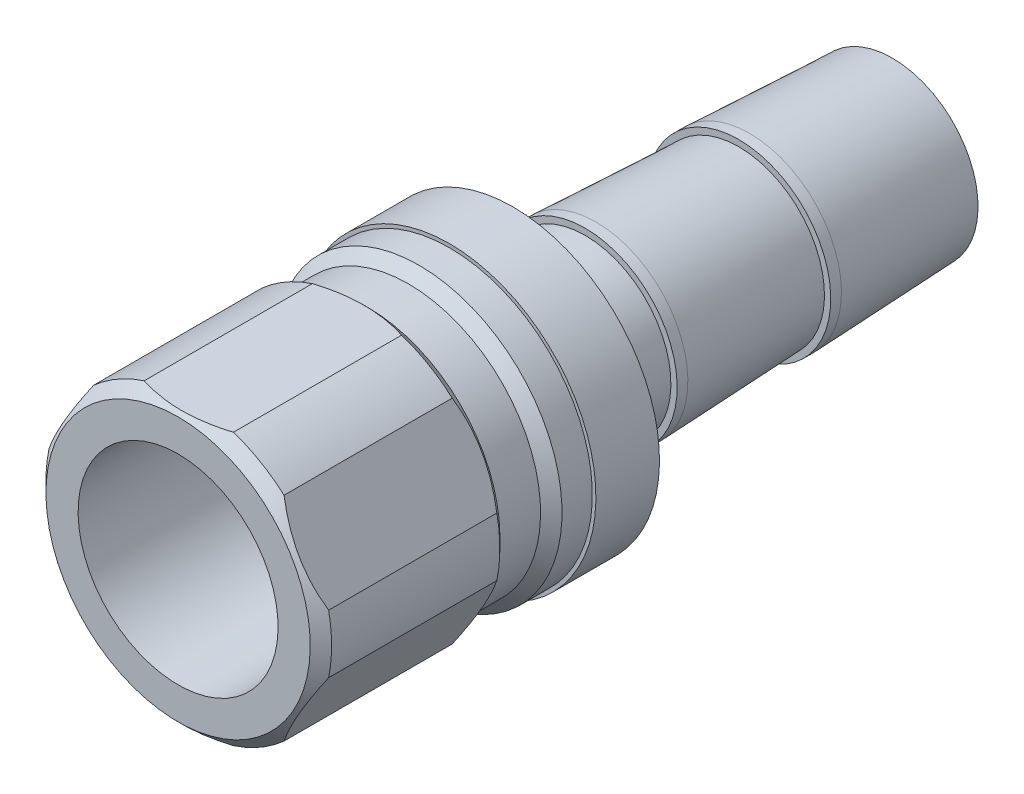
ISO-10303-21;
HEADER;
FILE_DESCRIPTION(('STEP AP214'),'2;1');
FILE_NAME('part.step','',(''),(''),'','','');
FILE_SCHEMA(('AUTOMOTIVE_DESIGN { 1 0 10303 214 1 1 1 1 }'));
ENDSEC;
DATA;
#1=APPLICATION_CONTEXT('core data for automotive mechanical design processes');
#2=APPLICATION_PROTOCOL_DEFINITION('international standard','automotive_design',2000,#1);
#3=PRODUCT_CONTEXT('',#1,'mechanical');
#4=PRODUCT('Part','Part','',(#3));
#5=PRODUCT_RELATED_PRODUCT_CATEGORY('part','',(#4));
#6=PRODUCT_DEFINITION_FORMATION('','',#4);
#7=PRODUCT_DEFINITION_CONTEXT('part definition',#1,'design');
#8=PRODUCT_DEFINITION('design','',#6,#7);
#9=PRODUCT_DEFINITION_SHAPE('','',#8);
#10=(LENGTH_UNIT() NAMED_UNIT(*) SI_UNIT(.MILLI.,.METRE.));
#11=(NAMED_UNIT(*) PLANE_ANGLE_UNIT() SI_UNIT($,.RADIAN.));
#12=(NAMED_UNIT(*) SI_UNIT($,.STERADIAN.) SOLID_ANGLE_UNIT());
#13=UNCERTAINTY_MEASURE_WITH_UNIT(LENGTH_MEASURE(1.E-05),#10,'distance_accuracy_value','');
#14=(GEOMETRIC_REPRESENTATION_CONTEXT(3) GLOBAL_UNCERTAINTY_ASSIGNED_CONTEXT((#13)) GLOBAL_UNIT_ASSIGNED_CONTEXT((#10,
#11,#12)) REPRESENTATION_CONTEXT('',''));
#15=CARTESIAN_POINT('',(0.,0.,0.));
#16=DIRECTION('',(0.,0.,1.));
#17=DIRECTION('',(1.,0.,0.));
#18=AXIS2_PLACEMENT_3D('',#15,#16,#17);
#19=CARTESIAN_POINT('',(0.,0.,5.8166));
#20=DIRECTION('',(0.,0.,1.));
#21=DIRECTION('',(0.,-1.,0.));
#22=AXIS2_PLACEMENT_3D('',#19,#20,#21);
#23=CONICAL_SURFACE('',#22,9.398,0.785398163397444);
#24=CARTESIAN_POINT('',(0.,0.,5.8166));
#25=DIRECTION('',(0.,0.,-1.));
#26=DIRECTION('',(0.,1.,0.));
#27=AXIS2_PLACEMENT_3D('',#24,#25,#26);
#28=CIRCLE('',#27,9.398);
#29=CARTESIAN_POINT('',(0.,9.398,5.8166));
#30=VERTEX_POINT('',#29);
#31=EDGE_CURVE('E378',#30,#30,#28,.T.);
#32=ORIENTED_EDGE('',*,*,#31,.F.);
#33=EDGE_LOOP('',(#32));
#34=FACE_BOUND('',#33,.T.);
#35=CARTESIAN_POINT('',(0.,0.,6.5786));
#36=DIRECTION('',(0.,0.,-1.));
#37=DIRECTION('',(0.,1.,0.));
#38=AXIS2_PLACEMENT_3D('',#35,#36,#37);
#39=CIRCLE('',#38,10.16);
#40=CARTESIAN_POINT('',(3.17245898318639,9.652,6.5786));
#41=VERTEX_POINT('',#40);
#42=CARTESIAN_POINT('',(6.77264770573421,7.57343007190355,6.5786));
#43=VERTEX_POINT('',#42);
#44=EDGE_CURVE('E144',#41,#43,#39,.T.);
#45=ORIENTED_EDGE('',*,*,#44,.T.);
#46=CARTESIAN_POINT('',(6.77232747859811,7.57398472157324,6.5788));
#47=CARTESIAN_POINT('',(6.89341829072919,7.36424928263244,6.50311112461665));
#48=CARTESIAN_POINT('',(7.01569298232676,7.15246330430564,6.43459987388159));
#49=CARTESIAN_POINT('',(7.26235241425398,6.72523663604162,6.31373109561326));
#50=CARTESIAN_POINT('',(7.38673927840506,6.50979226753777,6.26139098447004));
#51=CARTESIAN_POINT('',(7.6342103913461,6.08115972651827,6.17583376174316));
#52=CARTESIAN_POINT('',(7.75725829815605,5.86803450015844,6.14220261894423));
#53=CARTESIAN_POINT('',(8.00421289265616,5.44029659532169,6.0935108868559));
#54=CARTESIAN_POINT('',(8.12811912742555,5.22568470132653,6.07844115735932));
#55=CARTESIAN_POINT('',(8.39348588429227,4.76605599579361,6.06671407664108));
#56=CARTESIAN_POINT('',(8.53498085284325,4.52097952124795,6.07292266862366));
#57=CARTESIAN_POINT('',(8.81724838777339,4.03207780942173,6.10993961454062));
#58=CARTESIAN_POINT('',(8.95802033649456,3.78825364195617,6.14076631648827));
#59=CARTESIAN_POINT('',(9.24157809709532,3.2971171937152,6.22661050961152));
#60=CARTESIAN_POINT('',(9.38431610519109,3.04988771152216,6.28225688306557));
#61=CARTESIAN_POINT('',(9.59637283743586,2.68259467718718,6.38192162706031));
#62=CARTESIAN_POINT('',(9.66667910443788,2.56082065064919,6.41781854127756));
#63=CARTESIAN_POINT('',(9.80658614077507,2.31849455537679,6.49463428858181));
#64=CARTESIAN_POINT('',(9.87618706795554,2.1979422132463,6.53555196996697));
#65=CARTESIAN_POINT('',(9.94542691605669,2.07801527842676,6.5788));
#66=B_SPLINE_CURVE_WITH_KNOTS('',3,(#46,#47,#48,#49,#50,#51,#52,#53,#54,#55,#56,#57,#58,#59,#60,
#61,#62,#63,#64,#65),.UNSPECIFIED.,.F.,.F.,(4,2,2,2,2,2,2,2,2,4),(0.,0.761268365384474,
1.52335378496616,2.26782503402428,3.01192953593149,3.85997332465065,4.70864975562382,
5.58017277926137,6.01546212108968,6.45065179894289),.UNSPECIFIED.);
#67=CARTESIAN_POINT('',(9.94510668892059,2.07856992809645,6.5786));
#68=VERTEX_POINT('',#67);
#69=EDGE_CURVE('E196',#43,#68,#66,.T.);
#70=ORIENTED_EDGE('',*,*,#69,.T.);
#71=CARTESIAN_POINT('',(9.94510668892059,-2.07856992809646,6.5786));
#72=VERTEX_POINT('',#71);
#73=EDGE_CURVE('E309',#68,#72,#39,.T.);
#74=ORIENTED_EDGE('',*,*,#73,.T.);
#75=CARTESIAN_POINT('',(9.94542691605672,-2.07801527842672,6.57880000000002));
#76=CARTESIAN_POINT('',(9.82433610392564,-2.28775071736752,6.50311112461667));
#77=CARTESIAN_POINT('',(9.70206141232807,-2.49953669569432,6.4345998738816));
#78=CARTESIAN_POINT('',(9.45540198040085,-2.92676336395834,6.31373109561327));
#79=CARTESIAN_POINT('',(9.33101511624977,-3.14220773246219,6.26139098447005));
#80=CARTESIAN_POINT('',(9.08354400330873,-3.57084027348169,6.17583376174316));
#81=CARTESIAN_POINT('',(8.96049609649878,-3.78396549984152,6.14220261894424));
#82=CARTESIAN_POINT('',(8.71354150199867,-4.21170340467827,6.0935108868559));
#83=CARTESIAN_POINT('',(8.58963526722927,-4.42631529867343,6.07844115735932));
#84=CARTESIAN_POINT('',(8.32426851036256,-4.88594400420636,6.06671407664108));
#85=CARTESIAN_POINT('',(8.18277354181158,-5.13102047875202,6.07292266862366));
#86=CARTESIAN_POINT('',(7.90050600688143,-5.61992219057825,6.10993961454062));
#87=CARTESIAN_POINT('',(7.75973405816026,-5.86374635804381,6.14076631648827));
#88=CARTESIAN_POINT('',(7.47617629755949,-6.35488280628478,6.22661050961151));
#89=CARTESIAN_POINT('',(7.33343828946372,-6.60211228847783,6.28225688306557));
#90=CARTESIAN_POINT('',(7.12138155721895,-6.96940532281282,6.3819216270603));
#91=CARTESIAN_POINT('',(7.05107529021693,-7.09117934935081,6.41781854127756));
#92=CARTESIAN_POINT('',(6.91116825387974,-7.33350544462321,6.49463428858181));
#93=CARTESIAN_POINT('',(6.84156732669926,-7.4540577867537,6.53555196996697));
#94=CARTESIAN_POINT('',(6.77232747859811,-7.57398472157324,6.5788));
#95=B_SPLINE_CURVE_WITH_KNOTS('',3,(#75,#76,#77,#78,#79,#80,#81,#82,#83,#84,#85,#86,#87,#88,#89,
#90,#91,#92,#93,#94),.UNSPECIFIED.,.F.,.F.,(4,2,2,2,2,2,2,2,2,4),(0.,0.761268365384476,
1.52335378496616,2.26782503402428,3.01192953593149,3.85997332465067,4.70864975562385,
5.58017277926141,6.01546212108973,6.45065179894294),.UNSPECIFIED.);
#96=CARTESIAN_POINT('',(6.77264770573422,-7.57343007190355,6.5786));
#97=VERTEX_POINT('',#96);
#98=EDGE_CURVE('E295',#72,#97,#95,.T.);
#99=ORIENTED_EDGE('',*,*,#98,.T.);
#100=CARTESIAN_POINT('',(3.17245898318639,-9.652,6.5786));
#101=VERTEX_POINT('',#100);
#102=EDGE_CURVE('E320',#97,#101,#39,.T.);
#103=ORIENTED_EDGE('',*,*,#102,.T.);
#104=CARTESIAN_POINT('',(-11.1352624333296,-9.652,11.1547858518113));
#105=CARTESIAN_POINT('',(-10.8642266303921,-9.652,10.9500267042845));
#106=CARTESIAN_POINT('',(-10.5916756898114,-9.652,10.7472405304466));
#107=CARTESIAN_POINT('',(-10.0429449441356,-9.652,10.3464982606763));
#108=CARTESIAN_POINT('',(-9.76676424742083,-9.652,10.148543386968));
#109=CARTESIAN_POINT('',(-9.20815506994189,-9.652,9.75694022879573));
#110=CARTESIAN_POINT('',(-8.9256947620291,-9.652,9.56333719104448));
#111=CARTESIAN_POINT('',(-8.35598337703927,-9.652,9.18333627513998));
#112=CARTESIAN_POINT('',(-8.06873264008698,-9.652,8.99693788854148));
#113=CARTESIAN_POINT('',(-7.47202445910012,-9.652,8.62250123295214));
#114=CARTESIAN_POINT('',(-7.16223889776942,-9.652,8.43498320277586));
#115=CARTESIAN_POINT('',(-6.53543448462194,-9.652,8.07225423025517));
#116=CARTESIAN_POINT('',(-6.21841449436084,-9.652,7.89704524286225));
#117=CARTESIAN_POINT('',(-5.57716584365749,-9.652,7.56271276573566));
#118=CARTESIAN_POINT('',(-5.25296203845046,-9.652,7.4035419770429));
#119=CARTESIAN_POINT('',(-4.59569857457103,-9.652,7.10484931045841));
#120=CARTESIAN_POINT('',(-4.26264301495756,-9.652,6.96531851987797));
#121=CARTESIAN_POINT('',(-3.61460795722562,-9.652,6.72121817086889));
#122=CARTESIAN_POINT('',(-3.30035913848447,-9.652,6.61472890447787));
#123=CARTESIAN_POINT('',(-2.66427706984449,-9.652,6.42695824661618));
#124=CARTESIAN_POINT('',(-2.34244330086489,-9.652,6.345678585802));
#125=CARTESIAN_POINT('',(-1.69847617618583,-9.652,6.21393023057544));
#126=CARTESIAN_POINT('',(-1.37645288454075,-9.652,6.16293234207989));
#127=CARTESIAN_POINT('',(-0.728940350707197,-9.652,6.09274073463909));
#128=CARTESIAN_POINT('',(-0.403451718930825,-9.652,6.07354150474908));
#129=CARTESIAN_POINT('',(0.235900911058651,-9.652,6.06838203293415));
#130=CARTESIAN_POINT('',(0.549755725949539,-9.652,6.0812345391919));
#131=CARTESIAN_POINT('',(1.17478731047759,-9.652,6.13684430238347));
#132=CARTESIAN_POINT('',(1.48596381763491,-9.652,6.17960445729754));
#133=CARTESIAN_POINT('',(2.10864801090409,-9.652,6.29342042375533));
#134=CARTESIAN_POINT('',(2.42006612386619,-9.652,6.36495849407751));
#135=CARTESIAN_POINT('',(3.03611422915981,-9.652,6.53250870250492));
#136=CARTESIAN_POINT('',(3.34074477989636,-9.652,6.62851881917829));
#137=CARTESIAN_POINT('',(3.97032129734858,-9.652,6.85076014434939));
#138=CARTESIAN_POINT('',(4.29456666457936,-9.652,6.97895596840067));
#139=CARTESIAN_POINT('',(4.93463916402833,-9.652,7.25503482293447));
#140=CARTESIAN_POINT('',(5.25046229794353,-9.652,7.40292701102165));
#141=CARTESIAN_POINT('',(5.87523128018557,-9.652,7.7148805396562));
#142=CARTESIAN_POINT('',(6.1841515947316,-9.652,7.87899260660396));
#143=CARTESIAN_POINT('',(6.794884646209,-9.652,8.21975931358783));
#144=CARTESIAN_POINT('',(7.09669850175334,-9.652,8.3964119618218));
#145=CARTESIAN_POINT('',(7.67930267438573,-9.652,8.7507548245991));
#146=CARTESIAN_POINT('',(7.96039189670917,-9.652,8.92795617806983));
#147=CARTESIAN_POINT('',(8.51774450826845,-9.652,9.28981504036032));
#148=CARTESIAN_POINT('',(8.7940075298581,-9.652,9.47447311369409));
#149=CARTESIAN_POINT('',(9.34009999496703,-9.652,9.84838848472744));
#150=CARTESIAN_POINT('',(9.60996346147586,-9.652,10.037596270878));
#151=CARTESIAN_POINT('',(10.1460016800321,-9.652,10.421018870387));
#152=CARTESIAN_POINT('',(10.412177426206,-9.652,10.6152322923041));
#153=CARTESIAN_POINT('',(10.6768088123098,-9.652,10.8114923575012));
#154=B_SPLINE_CURVE_WITH_KNOTS('',3,(#104,#105,#106,#107,#108,#109,#110,#111,#112,#113,#114,
#115,#116,#117,#118,#119,#120,#121,#122,#123,#124,#125,#126,#127,#128,#129,#130,#131,#132,#133,
#134,#135,#136,#137,#138,#139,#140,#141,#142,#143,#144,#145,#146,#147,#148,#149,#150,#151,#152,
#153),.UNSPECIFIED.,.F.,.F.,(4,2,2,2,2,2,2,2,2,2,2,2,2,2,2,2,2,2,2,2,2,2,2,2,4),(0.,
1.01907869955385,2.03841258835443,3.06564368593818,4.09280215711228,5.17893148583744,
6.26523292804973,7.348230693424,8.43073539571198,9.42526640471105,10.419865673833,
11.3965289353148,12.3730229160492,13.3138869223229,14.25484210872,15.2122703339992,
16.1696194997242,17.2148092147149,18.2604865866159,19.3095444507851,20.3584360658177,
21.3551444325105,22.351928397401,23.3406197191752,24.3290391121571),.UNSPECIFIED.);
#155=CARTESIAN_POINT('',(-3.17245898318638,-9.652,6.5786));
#156=VERTEX_POINT('',#155);
#157=EDGE_CURVE('E321',#101,#156,#154,.F.);
#158=ORIENTED_EDGE('',*,*,#157,.T.);
#159=CARTESIAN_POINT('',(-6.77264770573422,-7.57343007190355,6.5786));
#160=VERTEX_POINT('',#159);
#161=EDGE_CURVE('E375',#156,#160,#39,.T.);
#162=ORIENTED_EDGE('',*,*,#161,.T.);
#163=CARTESIAN_POINT('',(-6.77232747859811,-7.57398472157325,6.5788));
#164=CARTESIAN_POINT('',(-6.89341829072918,-7.36424928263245,6.50311112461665));
#165=CARTESIAN_POINT('',(-7.01569298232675,-7.15246330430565,6.43459987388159));
#166=CARTESIAN_POINT('',(-7.26235241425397,-6.72523663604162,6.31373109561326));
#167=CARTESIAN_POINT('',(-7.38673927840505,-6.50979226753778,6.26139098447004));
#168=CARTESIAN_POINT('',(-7.6342103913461,-6.08115972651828,6.17583376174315));
#169=CARTESIAN_POINT('',(-7.75725829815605,-5.86803450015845,6.14220261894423));
#170=CARTESIAN_POINT('',(-8.00421289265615,-5.4402965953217,6.0935108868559));
#171=CARTESIAN_POINT('',(-8.12811912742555,-5.22568470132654,6.07844115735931));
#172=CARTESIAN_POINT('',(-8.39348588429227,-4.76605599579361,6.06671407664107));
#173=CARTESIAN_POINT('',(-8.53498085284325,-4.52097952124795,6.07292266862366));
#174=CARTESIAN_POINT('',(-8.81724838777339,-4.03207780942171,6.10993961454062));
#175=CARTESIAN_POINT('',(-8.95802033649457,-3.78825364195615,6.14076631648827));
#176=CARTESIAN_POINT('',(-9.24157809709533,-3.29711719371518,6.22661050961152));
#177=CARTESIAN_POINT('',(-9.38431610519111,-3.04988771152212,6.28225688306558));
#178=CARTESIAN_POINT('',(-9.59637283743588,-2.68259467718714,6.38192162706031));
#179=CARTESIAN_POINT('',(-9.6666791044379,-2.56082065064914,6.41781854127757));
#180=CARTESIAN_POINT('',(-9.80658614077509,-2.31849455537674,6.49463428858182));
#181=CARTESIAN_POINT('',(-9.87618706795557,-2.19794221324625,6.53555196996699));
#182=CARTESIAN_POINT('',(-9.94542691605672,-2.07801527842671,6.57880000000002));
#183=B_SPLINE_CURVE_WITH_KNOTS('',3,(#163,#164,#165,#166,#167,#168,#169,#170,#171,#172,#173,
#174,#175,#176,#177,#178,#179,#180,#181,#182),.UNSPECIFIED.,.F.,.F.,(4,2,2,2,2,2,2,2,2,4),(0.,
0.761268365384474,1.52335378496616,2.26782503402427,3.01192953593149,3.85997332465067,
4.70864975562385,5.58017277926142,6.01546212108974,6.45065179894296),.UNSPECIFIED.);
#184=CARTESIAN_POINT('',(-9.94510668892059,-2.07856992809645,6.5786));
#185=VERTEX_POINT('',#184);
#186=EDGE_CURVE('E333',#160,#185,#183,.T.);
#187=ORIENTED_EDGE('',*,*,#186,.T.);
#188=CARTESIAN_POINT('',(-9.94510668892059,2.07856992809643,6.5786));
#189=VERTEX_POINT('',#188);
#190=EDGE_CURVE('E154',#185,#189,#39,.T.);
#191=ORIENTED_EDGE('',*,*,#190,.T.);
#192=CARTESIAN_POINT('',(-9.9454269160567,2.07801527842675,6.5788));
#193=CARTESIAN_POINT('',(-9.82433610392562,2.28775071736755,6.50311112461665));
#194=CARTESIAN_POINT('',(-9.70206141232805,2.49953669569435,6.43459987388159));
#195=CARTESIAN_POINT('',(-9.45540198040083,2.92676336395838,6.31373109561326));
#196=CARTESIAN_POINT('',(-9.33101511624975,3.14220773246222,6.26139098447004));
#197=CARTESIAN_POINT('',(-9.0835440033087,3.57084027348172,6.17583376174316));
#198=CARTESIAN_POINT('',(-8.96049609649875,3.78396549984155,6.14220261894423));
#199=CARTESIAN_POINT('',(-8.71354150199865,4.2117034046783,6.0935108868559));
#200=CARTESIAN_POINT('',(-8.58963526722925,4.42631529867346,6.07844115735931));
#201=CARTESIAN_POINT('',(-8.32426851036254,4.88594400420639,6.06671407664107));
#202=CARTESIAN_POINT('',(-8.18277354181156,5.13102047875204,6.07292266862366));
#203=CARTESIAN_POINT('',(-7.90050600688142,5.61992219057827,6.10993961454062));
#204=CARTESIAN_POINT('',(-7.75973405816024,5.86374635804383,6.14076631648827));
#205=CARTESIAN_POINT('',(-7.47617629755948,6.3548828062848,6.22661050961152));
#206=CARTESIAN_POINT('',(-7.33343828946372,6.60211228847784,6.28225688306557));
#207=CARTESIAN_POINT('',(-7.12138155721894,6.96940532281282,6.3819216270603));
#208=CARTESIAN_POINT('',(-7.05107529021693,7.09117934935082,6.41781854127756));
#209=CARTESIAN_POINT('',(-6.91116825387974,7.33350544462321,6.49463428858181));
#210=CARTESIAN_POINT('',(-6.84156732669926,7.4540577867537,6.53555196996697));
#211=CARTESIAN_POINT('',(-6.77232747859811,7.57398472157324,6.5788));
#212=B_SPLINE_CURVE_WITH_KNOTS('',3,(#192,#193,#194,#195,#196,#197,#198,#199,#200,#201,#202,
#203,#204,#205,#206,#207,#208,#209,#210,#211),.UNSPECIFIED.,.F.,.F.,(4,2,2,2,2,2,2,2,2,4),(0.,
0.761268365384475,1.52335378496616,2.26782503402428,3.01192953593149,3.85997332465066,
4.70864975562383,5.58017277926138,6.01546212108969,6.4506517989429),.UNSPECIFIED.);
#213=CARTESIAN_POINT('',(-6.7726477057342,7.57343007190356,6.5786));
#214=VERTEX_POINT('',#213);
#215=EDGE_CURVE('E351',#189,#214,#212,.T.);
#216=ORIENTED_EDGE('',*,*,#215,.T.);
#217=CARTESIAN_POINT('',(-3.17245898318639,9.652,6.5786));
#218=VERTEX_POINT('',#217);
#219=EDGE_CURVE('E149',#214,#218,#39,.T.);
#220=ORIENTED_EDGE('',*,*,#219,.T.);
#221=CARTESIAN_POINT('',(-11.1352624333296,9.652,11.1547858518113));
#222=CARTESIAN_POINT('',(-10.8642266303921,9.652,10.9500267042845));
#223=CARTESIAN_POINT('',(-10.5916756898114,9.652,10.7472405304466));
#224=CARTESIAN_POINT('',(-10.0429449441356,9.652,10.3464982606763));
#225=CARTESIAN_POINT('',(-9.76676424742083,9.652,10.148543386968));
#226=CARTESIAN_POINT('',(-9.20815506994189,9.652,9.75694022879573));
#227=CARTESIAN_POINT('',(-8.9256947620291,9.652,9.56333719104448));
#228=CARTESIAN_POINT('',(-8.35598337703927,9.652,9.18333627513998));
#229=CARTESIAN_POINT('',(-8.06873264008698,9.652,8.99693788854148));
#230=CARTESIAN_POINT('',(-7.47202445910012,9.652,8.62250123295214));
#231=CARTESIAN_POINT('',(-7.16223889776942,9.652,8.43498320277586));
#232=CARTESIAN_POINT('',(-6.53543448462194,9.652,8.07225423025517));
#233=CARTESIAN_POINT('',(-6.21841449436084,9.652,7.89704524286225));
#234=CARTESIAN_POINT('',(-5.57716584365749,9.652,7.56271276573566));
#235=CARTESIAN_POINT('',(-5.25296203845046,9.652,7.4035419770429));
#236=CARTESIAN_POINT('',(-4.59569857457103,9.652,7.10484931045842));
#237=CARTESIAN_POINT('',(-4.26264301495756,9.652,6.96531851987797));
#238=CARTESIAN_POINT('',(-3.61460795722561,9.652,6.72121817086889));
#239=CARTESIAN_POINT('',(-3.30035913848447,9.652,6.61472890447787));
#240=CARTESIAN_POINT('',(-2.66427706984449,9.652,6.42695824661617));
#241=CARTESIAN_POINT('',(-2.34244330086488,9.652,6.345678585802));
#242=CARTESIAN_POINT('',(-1.69847617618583,9.652,6.21393023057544));
#243=CARTESIAN_POINT('',(-1.37645288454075,9.652,6.16293234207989));
#244=CARTESIAN_POINT('',(-0.728940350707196,9.652,6.09274073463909));
#245=CARTESIAN_POINT('',(-0.403451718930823,9.652,6.07354150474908));
#246=CARTESIAN_POINT('',(0.235900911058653,9.652,6.06838203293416));
#247=CARTESIAN_POINT('',(0.54975572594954,9.652,6.0812345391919));
#248=CARTESIAN_POINT('',(1.17478731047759,9.652,6.13684430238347));
#249=CARTESIAN_POINT('',(1.48596381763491,9.652,6.17960445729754));
#250=CARTESIAN_POINT('',(2.10864801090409,9.652,6.29342042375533));
#251=CARTESIAN_POINT('',(2.42006612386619,9.652,6.36495849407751));
#252=CARTESIAN_POINT('',(3.03611422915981,9.652,6.53250870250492));
#253=CARTESIAN_POINT('',(3.34074477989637,9.652,6.62851881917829));
#254=CARTESIAN_POINT('',(3.97032129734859,9.652,6.8507601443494));
#255=CARTESIAN_POINT('',(4.29456666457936,9.652,6.97895596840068));
#256=CARTESIAN_POINT('',(4.93463916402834,9.652,7.25503482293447));
#257=CARTESIAN_POINT('',(5.25046229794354,9.652,7.40292701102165));
#258=CARTESIAN_POINT('',(5.87523128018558,9.652,7.71488053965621));
#259=CARTESIAN_POINT('',(6.18415159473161,9.652,7.87899260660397));
#260=CARTESIAN_POINT('',(6.794884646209,9.652,8.21975931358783));
#261=CARTESIAN_POINT('',(7.09669850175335,9.652,8.3964119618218));
#262=CARTESIAN_POINT('',(7.67930267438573,9.652,8.75075482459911));
#263=CARTESIAN_POINT('',(7.96039189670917,9.652,8.92795617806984));
#264=CARTESIAN_POINT('',(8.51774450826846,9.652,9.28981504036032));
#265=CARTESIAN_POINT('',(8.7940075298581,9.652,9.47447311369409));
#266=CARTESIAN_POINT('',(9.34009999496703,9.652,9.84838848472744));
#267=CARTESIAN_POINT('',(9.60996346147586,9.652,10.037596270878));
#268=CARTESIAN_POINT('',(10.1460016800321,9.652,10.421018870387));
#269=CARTESIAN_POINT('',(10.412177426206,9.652,10.6152322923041));
#270=CARTESIAN_POINT('',(10.6768088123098,9.652,10.8114923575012));
#271=B_SPLINE_CURVE_WITH_KNOTS('',3,(#221,#222,#223,#224,#225,#226,#227,#228,#229,#230,#231,
#232,#233,#234,#235,#236,#237,#238,#239,#240,#241,#242,#243,#244,#245,#246,#247,#248,#249,#250,
#251,#252,#253,#254,#255,#256,#257,#258,#259,#260,#261,#262,#263,#264,#265,#266,#267,#268,#269,
#270),.UNSPECIFIED.,.F.,.F.,(4,2,2,2,2,2,2,2,2,2,2,2,2,2,2,2,2,2,2,2,2,2,2,2,4),(0.,
1.01907869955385,2.03841258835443,3.06564368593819,4.09280215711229,5.17893148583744,
6.26523292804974,7.348230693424,8.43073539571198,9.42526640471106,10.419865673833,
11.3965289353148,12.3730229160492,13.3138869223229,14.25484210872,15.2122703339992,
16.1696194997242,17.2148092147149,18.2604865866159,19.3095444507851,20.3584360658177,
21.3551444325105,22.351928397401,23.3406197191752,24.3290391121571),.UNSPECIFIED.);
#272=EDGE_CURVE('E145',#218,#41,#271,.T.);
#273=ORIENTED_EDGE('',*,*,#272,.T.);
#274=EDGE_LOOP('',(#45,#70,#74,#99,#103,#158,#162,#187,#191,#216,#220,#273));
#275=FACE_BOUND('',#274,.T.);
#276=ADVANCED_FACE('F34',(#34,#275),#23,.T.);
#277=CARTESIAN_POINT('',(0.,0.,0.));
#278=DIRECTION('',(0.,0.,-1.));
#279=DIRECTION('',(0.,1.,0.));
#280=AXIS2_PLACEMENT_3D('',#277,#278,#279);
#281=CYLINDRICAL_SURFACE('',#280,10.16);
#282=ORIENTED_EDGE('',*,*,#73,.F.);
#283=DIRECTION('',(0.,0.,-1.));
#284=VECTOR('',#283,1.);
#285=CARTESIAN_POINT('',(9.94510668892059,2.07856992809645,0.));
#286=LINE('',#285,#284);
#287=CARTESIAN_POINT('',(9.94510668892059,2.07856992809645,18.542));
#288=VERTEX_POINT('',#287);
#289=EDGE_CURVE('E203',#68,#288,#286,.F.);
#290=ORIENTED_EDGE('',*,*,#289,.T.);
#291=CARTESIAN_POINT('',(0.,0.,18.542));
#292=DIRECTION('',(0.,0.,-1.));
#293=DIRECTION('',(0.,1.,0.));
#294=AXIS2_PLACEMENT_3D('',#291,#292,#293);
#295=CIRCLE('',#294,10.16);
#296=CARTESIAN_POINT('',(9.9451066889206,-2.07856992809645,18.542));
#297=VERTEX_POINT('',#296);
#298=EDGE_CURVE('E150',#288,#297,#295,.T.);
#299=ORIENTED_EDGE('',*,*,#298,.T.);
#300=DIRECTION('',(0.,0.,-1.));
#301=VECTOR('',#300,1.);
#302=CARTESIAN_POINT('',(9.94510668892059,-2.07856992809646,0.));
#303=LINE('',#302,#301);
#304=EDGE_CURVE('E314',#297,#72,#303,.T.);
#305=ORIENTED_EDGE('',*,*,#304,.T.);
#306=EDGE_LOOP('',(#282,#290,#299,#305));
#307=FACE_BOUND('',#306,.T.);
#308=ADVANCED_FACE('F257',(#307),#281,.T.);
#309=CARTESIAN_POINT('',(3.17245898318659,9.652,18.5420000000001));
#310=VERTEX_POINT('',#309);
#311=CARTESIAN_POINT('',(6.77264770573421,7.57343007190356,18.542));
#312=VERTEX_POINT('',#311);
#313=EDGE_CURVE('E142',#310,#312,#295,.T.);
#314=ORIENTED_EDGE('',*,*,#313,.T.);
#315=DIRECTION('',(0.,0.,-1.));
#316=VECTOR('',#315,1.);
#317=CARTESIAN_POINT('',(6.77264770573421,7.57343007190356,0.));
#318=LINE('',#317,#316);
#319=EDGE_CURVE('E301',#312,#43,#318,.T.);
#320=ORIENTED_EDGE('',*,*,#319,.T.);
#321=ORIENTED_EDGE('',*,*,#44,.F.);
#322=DIRECTION('',(0.,0.,-1.));
#323=VECTOR('',#322,1.);
#324=CARTESIAN_POINT('',(3.17245898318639,9.652,0.));
#325=LINE('',#324,#323);
#326=EDGE_CURVE('E128',#41,#310,#325,.F.);
#327=ORIENTED_EDGE('',*,*,#326,.T.);
#328=EDGE_LOOP('',(#314,#320,#321,#327));
#329=FACE_BOUND('',#328,.T.);
#330=ADVANCED_FACE('F140',(#329),#281,.T.);
#331=ORIENTED_EDGE('',*,*,#102,.F.);
#332=DIRECTION('',(0.,0.,-1.));
#333=VECTOR('',#332,1.);
#334=CARTESIAN_POINT('',(6.77264770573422,-7.57343007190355,0.));
#335=LINE('',#334,#333);
#336=CARTESIAN_POINT('',(6.77264770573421,-7.57343007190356,18.542));
#337=VERTEX_POINT('',#336);
#338=EDGE_CURVE('E302',#97,#337,#335,.F.);
#339=ORIENTED_EDGE('',*,*,#338,.T.);
#340=CARTESIAN_POINT('',(3.1724589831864,-9.652,18.542));
#341=VERTEX_POINT('',#340);
#342=EDGE_CURVE('E157',#337,#341,#295,.T.);
#343=ORIENTED_EDGE('',*,*,#342,.T.);
#344=DIRECTION('',(0.,0.,-1.));
#345=VECTOR('',#344,1.);
#346=CARTESIAN_POINT('',(3.17245898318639,-9.652,0.));
#347=LINE('',#346,#345);
#348=EDGE_CURVE('E331',#341,#101,#347,.T.);
#349=ORIENTED_EDGE('',*,*,#348,.T.);
#350=EDGE_LOOP('',(#331,#339,#343,#349));
#351=FACE_BOUND('',#350,.T.);
#352=ADVANCED_FACE('F317',(#351),#281,.T.);
#353=ORIENTED_EDGE('',*,*,#161,.F.);
#354=DIRECTION('',(0.,0.,-1.));
#355=VECTOR('',#354,1.);
#356=CARTESIAN_POINT('',(-3.17245898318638,-9.652,0.));
#357=LINE('',#356,#355);
#358=CARTESIAN_POINT('',(-3.1724589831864,-9.652,18.542));
#359=VERTEX_POINT('',#358);
#360=EDGE_CURVE('E323',#156,#359,#357,.F.);
#361=ORIENTED_EDGE('',*,*,#360,.T.);
#362=CARTESIAN_POINT('',(-6.77264770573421,-7.57343007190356,18.542));
#363=VERTEX_POINT('',#362);
#364=EDGE_CURVE('E164',#359,#363,#295,.T.);
#365=ORIENTED_EDGE('',*,*,#364,.T.);
#366=DIRECTION('',(0.,0.,-1.));
#367=VECTOR('',#366,1.);
#368=CARTESIAN_POINT('',(-6.77264770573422,-7.57343007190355,0.));
#369=LINE('',#368,#367);
#370=EDGE_CURVE('E357',#363,#160,#369,.T.);
#371=ORIENTED_EDGE('',*,*,#370,.T.);
#372=EDGE_LOOP('',(#353,#361,#365,#371));
#373=FACE_BOUND('',#372,.T.);
#374=ADVANCED_FACE('F374',(#373),#281,.T.);
#375=ORIENTED_EDGE('',*,*,#190,.F.);
#376=DIRECTION('',(0.,0.,-1.));
#377=VECTOR('',#376,1.);
#378=CARTESIAN_POINT('',(-9.94510668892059,-2.07856992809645,0.));
#379=LINE('',#378,#377);
#380=CARTESIAN_POINT('',(-9.94510668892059,-2.07856992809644,18.542));
#381=VERTEX_POINT('',#380);
#382=EDGE_CURVE('E339',#185,#381,#379,.F.);
#383=ORIENTED_EDGE('',*,*,#382,.T.);
#384=CARTESIAN_POINT('',(-9.9451066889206,2.07856992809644,18.542));
#385=VERTEX_POINT('',#384);
#386=EDGE_CURVE('E159',#381,#385,#295,.T.);
#387=ORIENTED_EDGE('',*,*,#386,.T.);
#388=DIRECTION('',(0.,0.,-1.));
#389=VECTOR('',#388,1.);
#390=CARTESIAN_POINT('',(-9.94510668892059,2.07856992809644,0.));
#391=LINE('',#390,#389);
#392=EDGE_CURVE('E62',#385,#189,#391,.T.);
#393=ORIENTED_EDGE('',*,*,#392,.T.);
#394=EDGE_LOOP('',(#375,#383,#387,#393));
#395=FACE_BOUND('',#394,.T.);
#396=ADVANCED_FACE('F369',(#395),#281,.T.);
#397=ORIENTED_EDGE('',*,*,#219,.F.);
#398=DIRECTION('',(0.,0.,-1.));
#399=VECTOR('',#398,1.);
#400=CARTESIAN_POINT('',(-6.7726477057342,7.57343007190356,0.));
#401=LINE('',#400,#399);
#402=CARTESIAN_POINT('',(-6.77264770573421,7.57343007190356,18.542));
#403=VERTEX_POINT('',#402);
#404=EDGE_CURVE('E358',#214,#403,#401,.F.);
#405=ORIENTED_EDGE('',*,*,#404,.T.);
#406=CARTESIAN_POINT('',(-3.17245898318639,9.652,18.542));
#407=VERTEX_POINT('',#406);
#408=EDGE_CURVE('E152',#403,#407,#295,.T.);
#409=ORIENTED_EDGE('',*,*,#408,.T.);
#410=DIRECTION('',(0.,0.,-1.));
#411=VECTOR('',#410,1.);
#412=CARTESIAN_POINT('',(-3.17245898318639,9.652,0.));
#413=LINE('',#412,#411);
#414=EDGE_CURVE('E54',#407,#218,#413,.T.);
#415=ORIENTED_EDGE('',*,*,#414,.T.);
#416=EDGE_LOOP('',(#397,#405,#409,#415));
#417=FACE_BOUND('',#416,.T.);
#418=ADVANCED_FACE('F256',(#417),#281,.T.);
#419=CARTESIAN_POINT('',(0.,0.,18.542));
#420=DIRECTION('',(0.,0.,-1.));
#421=DIRECTION('',(0.,1.,0.));
#422=AXIS2_PLACEMENT_3D('',#419,#420,#421);
#423=CONICAL_SURFACE('',#422,10.16,0.785398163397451);
#424=CARTESIAN_POINT('',(0.,0.,19.304));
#425=DIRECTION('',(0.,0.,-1.));
#426=DIRECTION('',(0.,1.,0.));
#427=AXIS2_PLACEMENT_3D('',#424,#425,#426);
#428=CIRCLE('',#427,9.398);
#429=CARTESIAN_POINT('',(0.,9.398,19.304));
#430=VERTEX_POINT('',#429);
#431=EDGE_CURVE('E160',#430,#430,#428,.T.);
#432=ORIENTED_EDGE('',*,*,#431,.T.);
#433=EDGE_LOOP('',(#432));
#434=FACE_BOUND('',#433,.T.);
#435=ORIENTED_EDGE('',*,*,#298,.F.);
#436=CARTESIAN_POINT('',(9.94542691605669,2.07801527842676,18.5418));
#437=CARTESIAN_POINT('',(9.82433610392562,2.28775071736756,18.6174888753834));
#438=CARTESIAN_POINT('',(9.70206141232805,2.49953669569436,18.6860001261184));
#439=CARTESIAN_POINT('',(9.45540198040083,2.92676336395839,18.8068689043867));
#440=CARTESIAN_POINT('',(9.33101511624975,3.14220773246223,18.85920901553));
#441=CARTESIAN_POINT('',(9.0835440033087,3.57084027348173,18.9447662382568));
#442=CARTESIAN_POINT('',(8.96049609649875,3.78396549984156,18.9783973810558));
#443=CARTESIAN_POINT('',(8.71354150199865,4.21170340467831,19.0270891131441));
#444=CARTESIAN_POINT('',(8.58963526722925,4.42631529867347,19.0421588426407));
#445=CARTESIAN_POINT('',(8.32426851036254,4.88594400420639,19.0538859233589));
#446=CARTESIAN_POINT('',(8.18277354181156,5.13102047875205,19.0476773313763));
#447=CARTESIAN_POINT('',(7.90050600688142,5.61992219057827,19.0106603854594));
#448=CARTESIAN_POINT('',(7.75973405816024,5.86374635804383,18.9798336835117));
#449=CARTESIAN_POINT('',(7.47617629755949,6.3548828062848,18.8939894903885));
#450=CARTESIAN_POINT('',(7.33343828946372,6.60211228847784,18.8383431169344));
#451=CARTESIAN_POINT('',(7.12138155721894,6.96940532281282,18.7386783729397));
#452=CARTESIAN_POINT('',(7.05107529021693,7.09117934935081,18.7027814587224));
#453=CARTESIAN_POINT('',(6.91116825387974,7.33350544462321,18.6259657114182));
#454=CARTESIAN_POINT('',(6.84156732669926,7.4540577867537,18.585048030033));
#455=CARTESIAN_POINT('',(6.77232747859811,7.57398472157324,18.5418));
#456=B_SPLINE_CURVE_WITH_KNOTS('',3,(#436,#437,#438,#439,#440,#441,#442,#443,#444,#445,#446,
#447,#448,#449,#450,#451,#452,#453,#454,#455),.UNSPECIFIED.,.F.,.F.,(4,2,2,2,2,2,2,2,2,4),(0.,
0.761268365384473,1.52335378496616,2.26782503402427,3.01192953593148,3.85997332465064,
4.70864975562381,5.58017277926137,6.01546212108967,6.45065179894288),.UNSPECIFIED.);
#457=EDGE_CURVE('E12',#288,#312,#456,.T.);
#458=ORIENTED_EDGE('',*,*,#457,.T.);
#459=ORIENTED_EDGE('',*,*,#313,.F.);
#460=CARTESIAN_POINT('',(-11.1352624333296,9.652,13.9658141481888));
#461=CARTESIAN_POINT('',(-10.8642266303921,9.652,14.1705732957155));
#462=CARTESIAN_POINT('',(-10.5916756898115,9.652,14.3733594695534));
#463=CARTESIAN_POINT('',(-10.0429449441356,9.652,14.7741017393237));
#464=CARTESIAN_POINT('',(-9.76676424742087,9.652,14.972056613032));
#465=CARTESIAN_POINT('',(-9.20815506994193,9.652,15.3636597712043));
#466=CARTESIAN_POINT('',(-8.92569476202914,9.652,15.5572628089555));
#467=CARTESIAN_POINT('',(-8.3559833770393,9.652,15.93726372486));
#468=CARTESIAN_POINT('',(-8.06873264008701,9.652,16.1236621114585));
#469=CARTESIAN_POINT('',(-7.47202445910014,9.652,16.4980987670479));
#470=CARTESIAN_POINT('',(-7.16223889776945,9.652,16.6856167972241));
#471=CARTESIAN_POINT('',(-6.53543448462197,9.652,17.0483457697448));
#472=CARTESIAN_POINT('',(-6.21841449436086,9.652,17.2235547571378));
#473=CARTESIAN_POINT('',(-5.57716584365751,9.652,17.5578872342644));
#474=CARTESIAN_POINT('',(-5.25296203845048,9.652,17.7170580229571));
#475=CARTESIAN_POINT('',(-4.59569857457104,9.652,18.0157506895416));
#476=CARTESIAN_POINT('',(-4.26264301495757,9.652,18.155281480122));
#477=CARTESIAN_POINT('',(-3.61460795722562,9.652,18.3993818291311));
#478=CARTESIAN_POINT('',(-3.30035913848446,9.652,18.5058710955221));
#479=CARTESIAN_POINT('',(-2.66427706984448,9.652,18.6936417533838));
#480=CARTESIAN_POINT('',(-2.34244330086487,9.652,18.774921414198));
#481=CARTESIAN_POINT('',(-1.6984761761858,9.652,18.9066697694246));
#482=CARTESIAN_POINT('',(-1.37645288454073,9.652,18.9576676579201));
#483=CARTESIAN_POINT('',(-0.728940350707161,9.652,19.0278592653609));
#484=CARTESIAN_POINT('',(-0.403451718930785,9.652,19.0470584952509));
#485=CARTESIAN_POINT('',(0.235900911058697,9.652,19.0522179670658));
#486=CARTESIAN_POINT('',(0.549755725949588,9.652,19.0393654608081));
#487=CARTESIAN_POINT('',(1.17478731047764,9.652,18.9837556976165));
#488=CARTESIAN_POINT('',(1.48596381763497,9.652,18.9409955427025));
#489=CARTESIAN_POINT('',(2.10864801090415,9.652,18.8271795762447));
#490=CARTESIAN_POINT('',(2.42006612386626,9.652,18.7556415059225));
#491=CARTESIAN_POINT('',(3.03611422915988,9.652,18.5880912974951));
#492=CARTESIAN_POINT('',(3.34074477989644,9.652,18.4920811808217));
#493=CARTESIAN_POINT('',(3.97032129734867,9.652,18.2698398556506));
#494=CARTESIAN_POINT('',(4.29456666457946,9.652,18.1416440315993));
#495=CARTESIAN_POINT('',(4.93463916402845,9.652,17.8655651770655));
#496=CARTESIAN_POINT('',(5.25046229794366,9.652,17.7176729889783));
#497=CARTESIAN_POINT('',(5.87523128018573,9.652,17.4057194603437));
#498=CARTESIAN_POINT('',(6.18415159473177,9.652,17.241607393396));
#499=CARTESIAN_POINT('',(6.79488464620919,9.652,16.9008406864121));
#500=CARTESIAN_POINT('',(7.09669850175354,9.652,16.7241880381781));
#501=CARTESIAN_POINT('',(7.67930267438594,9.652,16.3698451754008));
#502=CARTESIAN_POINT('',(7.96039189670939,9.652,16.1926438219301));
#503=CARTESIAN_POINT('',(8.5177445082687,9.652,15.8307849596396));
#504=CARTESIAN_POINT('',(8.79400752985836,9.652,15.6461268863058));
#505=CARTESIAN_POINT('',(9.3400999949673,9.652,15.2722115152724));
#506=CARTESIAN_POINT('',(9.60996346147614,9.652,15.0830037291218));
#507=CARTESIAN_POINT('',(10.1460016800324,9.652,14.6995811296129));
#508=CARTESIAN_POINT('',(10.4121774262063,9.652,14.5053677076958));
#509=CARTESIAN_POINT('',(10.6768088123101,9.652,14.3091076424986));
#510=B_SPLINE_CURVE_WITH_KNOTS('',3,(#460,#461,#462,#463,#464,#465,#466,#467,#468,#469,#470,
#471,#472,#473,#474,#475,#476,#477,#478,#479,#480,#481,#482,#483,#484,#485,#486,#487,#488,#489,
#490,#491,#492,#493,#494,#495,#496,#497,#498,#499,#500,#501,#502,#503,#504,#505,#506,#507,#508,
#509),.UNSPECIFIED.,.F.,.F.,(4,2,2,2,2,2,2,2,2,2,2,2,2,2,2,2,2,2,2,2,2,2,2,2,4),(0.,
1.01907869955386,2.03841258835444,3.0656436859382,4.09280215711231,5.17893148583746,
6.26523292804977,7.34823069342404,8.43073539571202,9.4252664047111,10.419865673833,
11.3965289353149,12.3730229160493,13.313886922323,14.2548421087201,15.2122703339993,
16.1696194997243,17.2148092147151,18.2604865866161,19.3095444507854,20.358436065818,
21.3551444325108,22.3519283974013,23.3406197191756,24.3290391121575),.UNSPECIFIED.);
#511=EDGE_CURVE('E125',#310,#407,#510,.F.);
#512=ORIENTED_EDGE('',*,*,#511,.T.);
#513=ORIENTED_EDGE('',*,*,#408,.F.);
#514=CARTESIAN_POINT('',(-6.77232747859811,7.57398472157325,18.5418));
#515=CARTESIAN_POINT('',(-6.89341829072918,7.36424928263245,18.6174888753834));
#516=CARTESIAN_POINT('',(-7.01569298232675,7.15246330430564,18.6860001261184));
#517=CARTESIAN_POINT('',(-7.26235241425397,6.72523663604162,18.8068689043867));
#518=CARTESIAN_POINT('',(-7.38673927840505,6.50979226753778,18.85920901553));
#519=CARTESIAN_POINT('',(-7.6342103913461,6.08115972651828,18.9447662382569));
#520=CARTESIAN_POINT('',(-7.75725829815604,5.86803450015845,18.9783973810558));
#521=CARTESIAN_POINT('',(-8.00421289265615,5.4402965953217,19.0270891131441));
#522=CARTESIAN_POINT('',(-8.12811912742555,5.22568470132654,19.0421588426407));
#523=CARTESIAN_POINT('',(-8.39348588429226,4.76605599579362,19.0538859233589));
#524=CARTESIAN_POINT('',(-8.53498085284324,4.52097952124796,19.0476773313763));
#525=CARTESIAN_POINT('',(-8.81724838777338,4.03207780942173,19.0106603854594));
#526=CARTESIAN_POINT('',(-8.95802033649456,3.78825364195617,18.9798336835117));
#527=CARTESIAN_POINT('',(-9.24157809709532,3.2971171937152,18.8939894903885));
#528=CARTESIAN_POINT('',(-9.38431610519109,3.04988771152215,18.8383431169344));
#529=CARTESIAN_POINT('',(-9.59637283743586,2.68259467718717,18.7386783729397));
#530=CARTESIAN_POINT('',(-9.66667910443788,2.56082065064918,18.7027814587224));
#531=CARTESIAN_POINT('',(-9.80658614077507,2.31849455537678,18.6259657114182));
#532=CARTESIAN_POINT('',(-9.87618706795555,2.19794221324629,18.585048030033));
#533=CARTESIAN_POINT('',(-9.9454269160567,2.07801527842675,18.5418));
#534=B_SPLINE_CURVE_WITH_KNOTS('',3,(#514,#515,#516,#517,#518,#519,#520,#521,#522,#523,#524,
#525,#526,#527,#528,#529,#530,#531,#532,#533),.UNSPECIFIED.,.F.,.F.,(4,2,2,2,2,2,2,2,2,4),(0.,
0.761268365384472,1.52335378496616,2.26782503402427,3.01192953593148,3.85997332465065,
4.70864975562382,5.58017277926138,6.01546212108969,6.4506517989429),.UNSPECIFIED.);
#535=EDGE_CURVE('E134',#403,#385,#534,.T.);
#536=ORIENTED_EDGE('',*,*,#535,.T.);
#537=ORIENTED_EDGE('',*,*,#386,.F.);
#538=CARTESIAN_POINT('',(-9.94542691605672,-2.07801527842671,18.5418));
#539=CARTESIAN_POINT('',(-9.82433610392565,-2.28775071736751,18.6174888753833));
#540=CARTESIAN_POINT('',(-9.70206141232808,-2.49953669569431,18.6860001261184));
#541=CARTESIAN_POINT('',(-9.45540198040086,-2.92676336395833,18.8068689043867));
#542=CARTESIAN_POINT('',(-9.33101511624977,-3.14220773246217,18.85920901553));
#543=CARTESIAN_POINT('',(-9.08354400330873,-3.57084027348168,18.9447662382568));
#544=CARTESIAN_POINT('',(-8.96049609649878,-3.78396549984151,18.9783973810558));
#545=CARTESIAN_POINT('',(-8.71354150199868,-4.21170340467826,19.0270891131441));
#546=CARTESIAN_POINT('',(-8.58963526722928,-4.42631529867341,19.0421588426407));
#547=CARTESIAN_POINT('',(-8.32426851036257,-4.88594400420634,19.0538859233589));
#548=CARTESIAN_POINT('',(-8.18277354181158,-5.13102047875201,19.0476773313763));
#549=CARTESIAN_POINT('',(-7.90050600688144,-5.61992219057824,19.0106603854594));
#550=CARTESIAN_POINT('',(-7.75973405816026,-5.86374635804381,18.9798336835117));
#551=CARTESIAN_POINT('',(-7.47617629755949,-6.35488280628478,18.8939894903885));
#552=CARTESIAN_POINT('',(-7.33343828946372,-6.60211228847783,18.8383431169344));
#553=CARTESIAN_POINT('',(-7.12138155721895,-6.96940532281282,18.7386783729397));
#554=CARTESIAN_POINT('',(-7.05107529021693,-7.09117934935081,18.7027814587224));
#555=CARTESIAN_POINT('',(-6.91116825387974,-7.33350544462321,18.6259657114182));
#556=CARTESIAN_POINT('',(-6.84156732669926,-7.4540577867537,18.585048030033));
#557=CARTESIAN_POINT('',(-6.77232747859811,-7.57398472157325,18.5418));
#558=B_SPLINE_CURVE_WITH_KNOTS('',3,(#538,#539,#540,#541,#542,#543,#544,#545,#546,#547,#548,
#549,#550,#551,#552,#553,#554,#555,#556,#557),.UNSPECIFIED.,.F.,.F.,(4,2,2,2,2,2,2,2,2,4),(0.,
0.761268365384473,1.52335378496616,2.26782503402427,3.01192953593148,3.85997332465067,
4.70864975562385,5.58017277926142,6.01546212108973,6.45065179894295),.UNSPECIFIED.);
#559=EDGE_CURVE('E272',#381,#363,#558,.T.);
#560=ORIENTED_EDGE('',*,*,#559,.T.);
#561=ORIENTED_EDGE('',*,*,#364,.F.);
#562=CARTESIAN_POINT('',(-11.1352624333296,-9.652,13.9658141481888));
#563=CARTESIAN_POINT('',(-10.8642266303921,-9.652,14.1705732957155));
#564=CARTESIAN_POINT('',(-10.5916756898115,-9.652,14.3733594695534));
#565=CARTESIAN_POINT('',(-10.0429449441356,-9.652,14.7741017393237));
#566=CARTESIAN_POINT('',(-9.76676424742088,-9.652,14.972056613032));
#567=CARTESIAN_POINT('',(-9.20815506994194,-9.652,15.3636597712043));
#568=CARTESIAN_POINT('',(-8.92569476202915,-9.652,15.5572628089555));
#569=CARTESIAN_POINT('',(-8.35598337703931,-9.652,15.93726372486));
#570=CARTESIAN_POINT('',(-8.06873264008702,-9.652,16.1236621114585));
#571=CARTESIAN_POINT('',(-7.47202445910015,-9.652,16.4980987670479));
#572=CARTESIAN_POINT('',(-7.16223889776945,-9.652,16.6856167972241));
#573=CARTESIAN_POINT('',(-6.53543448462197,-9.652,17.0483457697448));
#574=CARTESIAN_POINT('',(-6.21841449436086,-9.652,17.2235547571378));
#575=CARTESIAN_POINT('',(-5.57716584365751,-9.652,17.5578872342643));
#576=CARTESIAN_POINT('',(-5.25296203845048,-9.652,17.7170580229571));
#577=CARTESIAN_POINT('',(-4.59569857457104,-9.652,18.0157506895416));
#578=CARTESIAN_POINT('',(-4.26264301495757,-9.652,18.155281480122));
#579=CARTESIAN_POINT('',(-3.61460795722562,-9.652,18.3993818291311));
#580=CARTESIAN_POINT('',(-3.30035913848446,-9.652,18.5058710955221));
#581=CARTESIAN_POINT('',(-2.66427706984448,-9.652,18.6936417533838));
#582=CARTESIAN_POINT('',(-2.34244330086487,-9.652,18.774921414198));
#583=CARTESIAN_POINT('',(-1.6984761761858,-9.652,18.9066697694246));
#584=CARTESIAN_POINT('',(-1.37645288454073,-9.652,18.9576676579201));
#585=CARTESIAN_POINT('',(-0.728940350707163,-9.652,19.0278592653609));
#586=CARTESIAN_POINT('',(-0.403451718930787,-9.652,19.0470584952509));
#587=CARTESIAN_POINT('',(0.235900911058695,-9.652,19.0522179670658));
#588=CARTESIAN_POINT('',(0.549755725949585,-9.652,19.0393654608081));
#589=CARTESIAN_POINT('',(1.17478731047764,-9.652,18.9837556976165));
#590=CARTESIAN_POINT('',(1.48596381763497,-9.652,18.9409955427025));
#591=CARTESIAN_POINT('',(2.10864801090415,-9.652,18.8271795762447));
#592=CARTESIAN_POINT('',(2.42006612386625,-9.652,18.7556415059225));
#593=CARTESIAN_POINT('',(3.03611422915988,-9.652,18.5880912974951));
#594=CARTESIAN_POINT('',(3.34074477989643,-9.652,18.4920811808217));
#595=CARTESIAN_POINT('',(3.97032129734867,-9.652,18.2698398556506));
#596=CARTESIAN_POINT('',(4.29456666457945,-9.652,18.1416440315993));
#597=CARTESIAN_POINT('',(4.93463916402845,-9.652,17.8655651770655));
#598=CARTESIAN_POINT('',(5.25046229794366,-9.652,17.7176729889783));
#599=CARTESIAN_POINT('',(5.87523128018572,-9.652,17.4057194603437));
#600=CARTESIAN_POINT('',(6.18415159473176,-9.652,17.241607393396));
#601=CARTESIAN_POINT('',(6.79488464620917,-9.652,16.9008406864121));
#602=CARTESIAN_POINT('',(7.09669850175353,-9.652,16.7241880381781));
#603=CARTESIAN_POINT('',(7.67930267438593,-9.652,16.3698451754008));
#604=CARTESIAN_POINT('',(7.96039189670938,-9.652,16.1926438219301));
#605=CARTESIAN_POINT('',(8.51774450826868,-9.652,15.8307849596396));
#606=CARTESIAN_POINT('',(8.79400752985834,-9.652,15.6461268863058));
#607=CARTESIAN_POINT('',(9.34009999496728,-9.652,15.2722115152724));
#608=CARTESIAN_POINT('',(9.60996346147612,-9.652,15.0830037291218));
#609=CARTESIAN_POINT('',(10.1460016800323,-9.652,14.6995811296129));
#610=CARTESIAN_POINT('',(10.4121774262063,-9.652,14.5053677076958));
#611=CARTESIAN_POINT('',(10.6768088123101,-9.652,14.3091076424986));
#612=B_SPLINE_CURVE_WITH_KNOTS('',3,(#562,#563,#564,#565,#566,#567,#568,#569,#570,#571,#572,
#573,#574,#575,#576,#577,#578,#579,#580,#581,#582,#583,#584,#585,#586,#587,#588,#589,#590,#591,
#592,#593,#594,#595,#596,#597,#598,#599,#600,#601,#602,#603,#604,#605,#606,#607,#608,#609,#610,
#611),.UNSPECIFIED.,.F.,.F.,(4,2,2,2,2,2,2,2,2,2,2,2,2,2,2,2,2,2,2,2,2,2,2,2,4),(0.,
1.01907869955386,2.03841258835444,3.0656436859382,4.09280215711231,5.17893148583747,
6.26523292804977,7.34823069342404,8.43073539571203,9.42526640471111,10.4198656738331,
11.3965289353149,12.3730229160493,13.313886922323,14.2548421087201,15.2122703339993,
16.1696194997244,17.2148092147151,18.2604865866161,19.3095444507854,20.358436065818,
21.3551444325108,22.3519283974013,23.3406197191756,24.3290391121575),.UNSPECIFIED.);
#613=EDGE_CURVE('E278',#359,#341,#612,.T.);
#614=ORIENTED_EDGE('',*,*,#613,.T.);
#615=ORIENTED_EDGE('',*,*,#342,.F.);
#616=CARTESIAN_POINT('',(6.77232747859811,-7.57398472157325,18.5418));
#617=CARTESIAN_POINT('',(6.89341829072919,-7.36424928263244,18.6174888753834));
#618=CARTESIAN_POINT('',(7.01569298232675,-7.15246330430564,18.6860001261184));
#619=CARTESIAN_POINT('',(7.26235241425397,-6.72523663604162,18.8068689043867));
#620=CARTESIAN_POINT('',(7.38673927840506,-6.50979226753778,18.85920901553));
#621=CARTESIAN_POINT('',(7.6342103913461,-6.08115972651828,18.9447662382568));
#622=CARTESIAN_POINT('',(7.75725829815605,-5.86803450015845,18.9783973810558));
#623=CARTESIAN_POINT('',(8.00421289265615,-5.4402965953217,19.0270891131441));
#624=CARTESIAN_POINT('',(8.12811912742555,-5.22568470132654,19.0421588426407));
#625=CARTESIAN_POINT('',(8.39348588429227,-4.76605599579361,19.0538859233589));
#626=CARTESIAN_POINT('',(8.53498085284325,-4.52097952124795,19.0476773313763));
#627=CARTESIAN_POINT('',(8.81724838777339,-4.03207780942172,19.0106603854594));
#628=CARTESIAN_POINT('',(8.95802033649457,-3.78825364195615,18.9798336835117));
#629=CARTESIAN_POINT('',(9.24157809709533,-3.29711719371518,18.8939894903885));
#630=CARTESIAN_POINT('',(9.38431610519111,-3.04988771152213,18.8383431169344));
#631=CARTESIAN_POINT('',(9.59637283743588,-2.68259467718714,18.7386783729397));
#632=CARTESIAN_POINT('',(9.6666791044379,-2.56082065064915,18.7027814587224));
#633=CARTESIAN_POINT('',(9.80658614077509,-2.31849455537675,18.6259657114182));
#634=CARTESIAN_POINT('',(9.87618706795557,-2.19794221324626,18.585048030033));
#635=CARTESIAN_POINT('',(9.94542691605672,-2.07801527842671,18.5418));
#636=B_SPLINE_CURVE_WITH_KNOTS('',3,(#616,#617,#618,#619,#620,#621,#622,#623,#624,#625,#626,
#627,#628,#629,#630,#631,#632,#633,#634,#635),.UNSPECIFIED.,.F.,.F.,(4,2,2,2,2,2,2,2,2,4),(0.,
0.761268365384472,1.52335378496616,2.26782503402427,3.01192953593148,3.85997332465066,
4.70864975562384,5.58017277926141,6.01546212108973,6.45065179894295),.UNSPECIFIED.);
#637=EDGE_CURVE('E47',#337,#297,#636,.T.);
#638=ORIENTED_EDGE('',*,*,#637,.T.);
#639=EDGE_LOOP('',(#435,#458,#459,#512,#513,#536,#537,#560,#561,#614,#615,#638));
#640=FACE_BOUND('',#639,.T.);
#641=ADVANCED_FACE('F148',(#434,#640),#423,.T.);
#642=CARTESIAN_POINT('',(0.,0.,0.));
#643=DIRECTION('',(0.,0.,-1.));
#644=DIRECTION('',(0.,1.,0.));
#645=AXIS2_PLACEMENT_3D('',#642,#643,#644);
#646=CYLINDRICAL_SURFACE('',#645,6.5405);
#647=CARTESIAN_POINT('',(0.,0.,-9.65199999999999));
#648=DIRECTION('',(0.,0.,-1.));
#649=DIRECTION('',(0.,1.,0.));
#650=AXIS2_PLACEMENT_3D('',#647,#648,#649);
#651=CIRCLE('',#650,6.5405);
#652=CARTESIAN_POINT('',(0.,6.5405,-9.65199999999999));
#653=VERTEX_POINT('',#652);
#654=EDGE_CURVE('E135',#653,#653,#651,.T.);
#655=ORIENTED_EDGE('',*,*,#654,.T.);
#656=EDGE_LOOP('',(#655));
#657=FACE_BOUND('',#656,.T.);
#658=CARTESIAN_POINT('',(0.,0.,-10.414));
#659=DIRECTION('',(0.,0.,-1.));
#660=DIRECTION('',(0.,1.,0.));
#661=AXIS2_PLACEMENT_3D('',#658,#659,#660);
#662=CIRCLE('',#661,6.5405);
#663=CARTESIAN_POINT('',(0.,6.5405,-10.414));
#664=VERTEX_POINT('',#663);
#665=EDGE_CURVE('E193',#664,#664,#662,.T.);
#666=ORIENTED_EDGE('',*,*,#665,.F.);
#667=EDGE_LOOP('',(#666));
#668=FACE_BOUND('',#667,.T.);
#669=ADVANCED_FACE('F36',(#657,#668),#646,.T.);
#670=CARTESIAN_POINT('',(0.,6.096,-9.65199999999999));
#671=DIRECTION('',(0.,0.,1.));
#672=DIRECTION('',(0.,-1.,0.));
#673=AXIS2_PLACEMENT_3D('',#670,#671,#672);
#674=PLANE('',#673);
#675=CARTESIAN_POINT('',(0.,0.,-9.65199999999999));
#676=DIRECTION('',(0.,0.,-1.));
#677=DIRECTION('',(0.,1.,0.));
#678=AXIS2_PLACEMENT_3D('',#675,#676,#677);
#679=CIRCLE('',#678,6.096);
#680=CARTESIAN_POINT('',(0.,6.096,-9.65199999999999));
#681=VERTEX_POINT('',#680);
#682=EDGE_CURVE('E402',#681,#681,#679,.T.);
#683=ORIENTED_EDGE('',*,*,#682,.T.);
#684=EDGE_LOOP('',(#683));
#685=FACE_BOUND('',#684,.T.);
#686=ORIENTED_EDGE('',*,*,#654,.F.);
#687=EDGE_LOOP('',(#686));
#688=FACE_BOUND('',#687,.T.);
#689=ADVANCED_FACE('F409',(#685,#688),#674,.T.);
#690=CARTESIAN_POINT('',(0.,0.,0.));
#691=DIRECTION('',(0.,0.,-1.));
#692=DIRECTION('',(0.,1.,0.));
#693=AXIS2_PLACEMENT_3D('',#690,#691,#692);
#694=CYLINDRICAL_SURFACE('',#693,6.096);
#695=CARTESIAN_POINT('',(0.,0.,-7.36599999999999));
#696=DIRECTION('',(0.,0.,-1.));
#697=DIRECTION('',(0.,1.,0.));
#698=AXIS2_PLACEMENT_3D('',#695,#696,#697);
#699=CIRCLE('',#698,6.096);
#700=CARTESIAN_POINT('',(0.,6.096,-7.36599999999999));
#701=VERTEX_POINT('',#700);
#702=EDGE_CURVE('E399',#701,#701,#699,.T.);
#703=ORIENTED_EDGE('',*,*,#702,.T.);
#704=EDGE_LOOP('',(#703));
#705=FACE_BOUND('',#704,.T.);
#706=ORIENTED_EDGE('',*,*,#682,.F.);
#707=EDGE_LOOP('',(#706));
#708=FACE_BOUND('',#707,.T.);
#709=ADVANCED_FACE('F411',(#705,#708),#694,.T.);
#710=CARTESIAN_POINT('',(0.,0.,-7.36599999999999));
#711=DIRECTION('',(0.,0.,1.));
#712=DIRECTION('',(0.,-1.,0.));
#713=AXIS2_PLACEMENT_3D('',#710,#711,#712);
#714=CONICAL_SURFACE('',#713,6.096,0.154996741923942);
#715=CARTESIAN_POINT('',(0.,0.,-4.5212));
#716=DIRECTION('',(0.,0.,-1.));
#717=DIRECTION('',(0.,1.,0.));
#718=AXIS2_PLACEMENT_3D('',#715,#716,#717);
#719=CIRCLE('',#718,6.5405);
#720=CARTESIAN_POINT('',(0.,6.5405,-4.5212));
#721=VERTEX_POINT('',#720);
#722=EDGE_CURVE('E396',#721,#721,#719,.T.);
#723=ORIENTED_EDGE('',*,*,#722,.T.);
#724=EDGE_LOOP('',(#723));
#725=FACE_BOUND('',#724,.T.);
#726=ORIENTED_EDGE('',*,*,#702,.F.);
#727=EDGE_LOOP('',(#726));
#728=FACE_BOUND('',#727,.T.);
#729=ADVANCED_FACE('F417',(#725,#728),#714,.T.);
#730=CARTESIAN_POINT('',(0.,10.414,-4.5212));
#731=DIRECTION('',(0.,0.,-1.));
#732=DIRECTION('',(0.,1.,0.));
#733=AXIS2_PLACEMENT_3D('',#730,#731,#732);
#734=PLANE('',#733);
#735=CARTESIAN_POINT('',(0.,0.,-4.5212));
#736=DIRECTION('',(0.,0.,-1.));
#737=DIRECTION('',(0.,1.,0.));
#738=AXIS2_PLACEMENT_3D('',#735,#736,#737);
#739=CIRCLE('',#738,10.414);
#740=CARTESIAN_POINT('',(0.,10.414,-4.52119999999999));
#741=VERTEX_POINT('',#740);
#742=EDGE_CURVE('E393',#741,#741,#739,.T.);
#743=ORIENTED_EDGE('',*,*,#742,.T.);
#744=EDGE_LOOP('',(#743));
#745=FACE_BOUND('',#744,.T.);
#746=ORIENTED_EDGE('',*,*,#722,.F.);
#747=EDGE_LOOP('',(#746));
#748=FACE_BOUND('',#747,.T.);
#749=ADVANCED_FACE('F592',(#745,#748),#734,.T.);
#750=CARTESIAN_POINT('',(0.,0.,0.));
#751=DIRECTION('',(0.,0.,-1.));
#752=DIRECTION('',(0.,1.,0.));
#753=AXIS2_PLACEMENT_3D('',#750,#751,#752);
#754=CYLINDRICAL_SURFACE('',#753,10.414);
#755=CARTESIAN_POINT('',(0.,0.,0.));
#756=DIRECTION('',(0.,0.,-1.));
#757=DIRECTION('',(0.,1.,0.));
#758=AXIS2_PLACEMENT_3D('',#755,#756,#757);
#759=CIRCLE('',#758,10.414);
#760=CARTESIAN_POINT('',(0.,10.414,0.));
#761=VERTEX_POINT('',#760);
#762=EDGE_CURVE('E390',#761,#761,#759,.T.);
#763=ORIENTED_EDGE('',*,*,#762,.T.);
#764=EDGE_LOOP('',(#763));
#765=FACE_BOUND('',#764,.T.);
#766=ORIENTED_EDGE('',*,*,#742,.F.);
#767=EDGE_LOOP('',(#766));
#768=FACE_BOUND('',#767,.T.);
#769=ADVANCED_FACE('F584',(#765,#768),#754,.T.);
#770=CARTESIAN_POINT('',(0.,10.16,0.));
#771=DIRECTION('',(0.,0.,1.));
#772=DIRECTION('',(0.,-1.,0.));
#773=AXIS2_PLACEMENT_3D('',#770,#771,#772);
#774=PLANE('',#773);
#775=CARTESIAN_POINT('',(0.,0.,0.));
#776=DIRECTION('',(0.,0.,-1.));
#777=DIRECTION('',(0.,1.,0.));
#778=AXIS2_PLACEMENT_3D('',#775,#776,#777);
#779=CIRCLE('',#778,10.16);
#780=CARTESIAN_POINT('',(0.,10.16,0.));
#781=VERTEX_POINT('',#780);
#782=EDGE_CURVE('E387',#781,#781,#779,.T.);
#783=ORIENTED_EDGE('',*,*,#782,.T.);
#784=EDGE_LOOP('',(#783));
#785=FACE_BOUND('',#784,.T.);
#786=ORIENTED_EDGE('',*,*,#762,.F.);
#787=EDGE_LOOP('',(#786));
#788=FACE_BOUND('',#787,.T.);
#789=ADVANCED_FACE('F576',(#785,#788),#774,.T.);
#790=CARTESIAN_POINT('',(0.,0.,0.));
#791=DIRECTION('',(0.,0.,-1.));
#792=DIRECTION('',(0.,1.,0.));
#793=AXIS2_PLACEMENT_3D('',#790,#791,#792);
#794=CYLINDRICAL_SURFACE('',#793,10.16);
#795=CARTESIAN_POINT('',(0.,0.,2.159));
#796=DIRECTION('',(0.,0.,-1.));
#797=DIRECTION('',(0.,1.,0.));
#798=AXIS2_PLACEMENT_3D('',#795,#796,#797);
#799=CIRCLE('',#798,10.16);
#800=CARTESIAN_POINT('',(0.,10.16,2.159));
#801=VERTEX_POINT('',#800);
#802=EDGE_CURVE('E384',#801,#801,#799,.T.);
#803=ORIENTED_EDGE('',*,*,#802,.T.);
#804=EDGE_LOOP('',(#803));
#805=FACE_BOUND('',#804,.T.);
#806=ORIENTED_EDGE('',*,*,#782,.F.);
#807=EDGE_LOOP('',(#806));
#808=FACE_BOUND('',#807,.T.);
#809=ADVANCED_FACE('F568',(#805,#808),#794,.T.);
#810=CARTESIAN_POINT('',(0.,0.,2.159));
#811=DIRECTION('',(0.,0.,-1.));
#812=DIRECTION('',(0.,1.,0.));
#813=AXIS2_PLACEMENT_3D('',#810,#811,#812);
#814=CONICAL_SURFACE('',#813,10.16,0.785398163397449);
#815=CARTESIAN_POINT('',(0.,0.,2.921));
#816=DIRECTION('',(0.,0.,-1.));
#817=DIRECTION('',(0.,1.,0.));
#818=AXIS2_PLACEMENT_3D('',#815,#816,#817);
#819=CIRCLE('',#818,9.398);
#820=CARTESIAN_POINT('',(0.,9.398,2.921));
#821=VERTEX_POINT('',#820);
#822=EDGE_CURVE('E381',#821,#821,#819,.T.);
#823=ORIENTED_EDGE('',*,*,#822,.T.);
#824=EDGE_LOOP('',(#823));
#825=FACE_BOUND('',#824,.T.);
#826=ORIENTED_EDGE('',*,*,#802,.F.);
#827=EDGE_LOOP('',(#826));
#828=FACE_BOUND('',#827,.T.);
#829=ADVANCED_FACE('F561',(#825,#828),#814,.T.);
#830=CARTESIAN_POINT('',(0.,0.,0.));
#831=DIRECTION('',(0.,0.,-1.));
#832=DIRECTION('',(0.,1.,0.));
#833=AXIS2_PLACEMENT_3D('',#830,#831,#832);
#834=CYLINDRICAL_SURFACE('',#833,9.398);
#835=ORIENTED_EDGE('',*,*,#31,.T.);
#836=EDGE_LOOP('',(#835));
#837=FACE_BOUND('',#836,.T.);
#838=ORIENTED_EDGE('',*,*,#822,.F.);
#839=EDGE_LOOP('',(#838));
#840=FACE_BOUND('',#839,.T.);
#841=ADVANCED_FACE('F252',(#837,#840),#834,.T.);
#842=CARTESIAN_POINT('',(0.,7.112,19.304));
#843=DIRECTION('',(0.,0.,1.));
#844=DIRECTION('',(0.,-1.,0.));
#845=AXIS2_PLACEMENT_3D('',#842,#843,#844);
#846=PLANE('',#845);
#847=CARTESIAN_POINT('',(0.,0.,19.304));
#848=DIRECTION('',(0.,0.,-1.));
#849=DIRECTION('',(0.,1.,0.));
#850=AXIS2_PLACEMENT_3D('',#847,#848,#849);
#851=CIRCLE('',#850,7.112);
#852=CARTESIAN_POINT('',(0.,7.112,19.304));
#853=VERTEX_POINT('',#852);
#854=EDGE_CURVE('E166',#853,#853,#851,.T.);
#855=ORIENTED_EDGE('',*,*,#854,.T.);
#856=EDGE_LOOP('',(#855));
#857=FACE_BOUND('',#856,.T.);
#858=ORIENTED_EDGE('',*,*,#431,.F.);
#859=EDGE_LOOP('',(#858));
#860=FACE_BOUND('',#859,.T.);
#861=ADVANCED_FACE('F249',(#857,#860),#846,.T.);
#862=CARTESIAN_POINT('',(0.,0.,0.));
#863=DIRECTION('',(0.,0.,-1.));
#864=DIRECTION('',(0.,1.,0.));
#865=AXIS2_PLACEMENT_3D('',#862,#863,#864);
#866=CYLINDRICAL_SURFACE('',#865,7.112);
#867=CARTESIAN_POINT('',(0.,0.,4.699));
#868=DIRECTION('',(0.,0.,-1.));
#869=DIRECTION('',(0.,1.,0.));
#870=AXIS2_PLACEMENT_3D('',#867,#868,#869);
#871=CIRCLE('',#870,7.112);
#872=CARTESIAN_POINT('',(0.,7.112,4.699));
#873=VERTEX_POINT('',#872);
#874=EDGE_CURVE('E170',#873,#873,#871,.T.);
#875=ORIENTED_EDGE('',*,*,#874,.T.);
#876=EDGE_LOOP('',(#875));
#877=FACE_BOUND('',#876,.T.);
#878=ORIENTED_EDGE('',*,*,#854,.F.);
#879=EDGE_LOOP('',(#878));
#880=FACE_BOUND('',#879,.T.);
#881=ADVANCED_FACE('F245',(#877,#880),#866,.F.);
#882=CARTESIAN_POINT('',(0.,0.,4.699));
#883=DIRECTION('',(0.,0.,1.));
#884=DIRECTION('',(0.,-1.,0.));
#885=AXIS2_PLACEMENT_3D('',#882,#883,#884);
#886=CONICAL_SURFACE('',#885,7.112,1.08210413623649);
#887=CARTESIAN_POINT('',(0.,0.,3.66077087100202));
#888=DIRECTION('',(0.,0.,-1.));
#889=DIRECTION('',(0.,1.,0.));
#890=AXIS2_PLACEMENT_3D('',#887,#888,#889);
#891=CIRCLE('',#890,5.159375);
#892=CARTESIAN_POINT('',(0.,5.159375,3.66077087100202));
#893=VERTEX_POINT('',#892);
#894=EDGE_CURVE('E175',#893,#893,#891,.T.);
#895=ORIENTED_EDGE('',*,*,#894,.T.);
#896=EDGE_LOOP('',(#895));
#897=FACE_BOUND('',#896,.T.);
#898=ORIENTED_EDGE('',*,*,#874,.F.);
#899=EDGE_LOOP('',(#898));
#900=FACE_BOUND('',#899,.T.);
#901=ADVANCED_FACE('F241',(#897,#900),#886,.F.);
#902=CARTESIAN_POINT('',(0.,0.,0.));
#903=DIRECTION('',(0.,0.,-1.));
#904=DIRECTION('',(0.,1.,0.));
#905=AXIS2_PLACEMENT_3D('',#902,#903,#904);
#906=CYLINDRICAL_SURFACE('',#905,5.159375);
#907=CARTESIAN_POINT('',(0.,0.,-31.496));
#908=DIRECTION('',(0.,0.,-1.));
#909=DIRECTION('',(0.,1.,0.));
#910=AXIS2_PLACEMENT_3D('',#907,#908,#909);
#911=CIRCLE('',#910,5.159375);
#912=CARTESIAN_POINT('',(0.,5.159375,-31.496));
#913=VERTEX_POINT('',#912);
#914=EDGE_CURVE('E178',#913,#913,#911,.T.);
#915=ORIENTED_EDGE('',*,*,#914,.T.);
#916=EDGE_LOOP('',(#915));
#917=FACE_BOUND('',#916,.T.);
#918=ORIENTED_EDGE('',*,*,#894,.F.);
#919=EDGE_LOOP('',(#918));
#920=FACE_BOUND('',#919,.T.);
#921=ADVANCED_FACE('F237',(#917,#920),#906,.F.);
#922=CARTESIAN_POINT('',(0.,6.096,-31.496));
#923=DIRECTION('',(0.,0.,-1.));
#924=DIRECTION('',(0.,1.,0.));
#925=AXIS2_PLACEMENT_3D('',#922,#923,#924);
#926=PLANE('',#925);
#927=CARTESIAN_POINT('',(0.,0.,-31.496));
#928=DIRECTION('',(0.,0.,-1.));
#929=DIRECTION('',(0.,1.,0.));
#930=AXIS2_PLACEMENT_3D('',#927,#928,#929);
#931=CIRCLE('',#930,6.09599999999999);
#932=CARTESIAN_POINT('',(0.,6.096,-31.496));
#933=VERTEX_POINT('',#932);
#934=EDGE_CURVE('E181',#933,#933,#931,.T.);
#935=ORIENTED_EDGE('',*,*,#934,.T.);
#936=EDGE_LOOP('',(#935));
#937=FACE_BOUND('',#936,.T.);
#938=ORIENTED_EDGE('',*,*,#914,.F.);
#939=EDGE_LOOP('',(#938));
#940=FACE_BOUND('',#939,.T.);
#941=ADVANCED_FACE('F233',(#937,#940),#926,.T.);
#942=CARTESIAN_POINT('',(0.,0.,-31.496));
#943=DIRECTION('',(0.,0.,1.));
#944=DIRECTION('',(0.,-1.,0.));
#945=AXIS2_PLACEMENT_3D('',#942,#943,#944);
#946=CONICAL_SURFACE('',#945,6.09599999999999,0.0437221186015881);
#947=CARTESIAN_POINT('',(0.,0.,-21.336));
#948=DIRECTION('',(0.,0.,-1.));
#949=DIRECTION('',(0.,1.,0.));
#950=AXIS2_PLACEMENT_3D('',#947,#948,#949);
#951=CIRCLE('',#950,6.5405);
#952=CARTESIAN_POINT('',(0.,6.5405,-21.336));
#953=VERTEX_POINT('',#952);
#954=EDGE_CURVE('E184',#953,#953,#951,.T.);
#955=ORIENTED_EDGE('',*,*,#954,.T.);
#956=EDGE_LOOP('',(#955));
#957=FACE_BOUND('',#956,.T.);
#958=ORIENTED_EDGE('',*,*,#934,.F.);
#959=EDGE_LOOP('',(#958));
#960=FACE_BOUND('',#959,.T.);
#961=ADVANCED_FACE('F229',(#957,#960),#946,.T.);
#962=CARTESIAN_POINT('',(0.,0.,0.));
#963=DIRECTION('',(0.,0.,-1.));
#964=DIRECTION('',(0.,1.,0.));
#965=AXIS2_PLACEMENT_3D('',#962,#963,#964);
#966=CYLINDRICAL_SURFACE('',#965,6.5405);
#967=CARTESIAN_POINT('',(0.,0.,-20.574));
#968=DIRECTION('',(0.,0.,-1.));
#969=DIRECTION('',(0.,1.,0.));
#970=AXIS2_PLACEMENT_3D('',#967,#968,#969);
#971=CIRCLE('',#970,6.5405);
#972=CARTESIAN_POINT('',(0.,6.5405,-20.574));
#973=VERTEX_POINT('',#972);
#974=EDGE_CURVE('E187',#973,#973,#971,.T.);
#975=ORIENTED_EDGE('',*,*,#974,.T.);
#976=EDGE_LOOP('',(#975));
#977=FACE_BOUND('',#976,.T.);
#978=ORIENTED_EDGE('',*,*,#954,.F.);
#979=EDGE_LOOP('',(#978));
#980=FACE_BOUND('',#979,.T.);
#981=ADVANCED_FACE('F225',(#977,#980),#966,.T.);
#982=CARTESIAN_POINT('',(0.,6.096,-20.574));
#983=DIRECTION('',(0.,0.,1.));
#984=DIRECTION('',(0.,-1.,0.));
#985=AXIS2_PLACEMENT_3D('',#982,#983,#984);
#986=PLANE('',#985);
#987=CARTESIAN_POINT('',(0.,0.,-20.574));
#988=DIRECTION('',(0.,0.,-1.));
#989=DIRECTION('',(0.,1.,0.));
#990=AXIS2_PLACEMENT_3D('',#987,#988,#989);
#991=CIRCLE('',#990,6.096);
#992=CARTESIAN_POINT('',(0.,6.096,-20.574));
#993=VERTEX_POINT('',#992);
#994=EDGE_CURVE('E190',#993,#993,#991,.T.);
#995=ORIENTED_EDGE('',*,*,#994,.T.);
#996=EDGE_LOOP('',(#995));
#997=FACE_BOUND('',#996,.T.);
#998=ORIENTED_EDGE('',*,*,#974,.F.);
#999=EDGE_LOOP('',(#998));
#1000=FACE_BOUND('',#999,.T.);
#1001=ADVANCED_FACE('F221',(#997,#1000),#986,.T.);
#1002=CARTESIAN_POINT('',(0.,0.,-20.574));
#1003=DIRECTION('',(0.,0.,1.));
#1004=DIRECTION('',(0.,-1.,0.));
#1005=AXIS2_PLACEMENT_3D('',#1002,#1003,#1004);
#1006=CONICAL_SURFACE('',#1005,6.096,0.043722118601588);
#1007=ORIENTED_EDGE('',*,*,#665,.T.);
#1008=EDGE_LOOP('',(#1007));
#1009=FACE_BOUND('',#1008,.T.);
#1010=ORIENTED_EDGE('',*,*,#994,.F.);
#1011=EDGE_LOOP('',(#1010));
#1012=FACE_BOUND('',#1011,.T.);
#1013=ADVANCED_FACE('F217',(#1009,#1012),#1006,.T.);
#1014=CARTESIAN_POINT('',(5.57258479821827,9.652,3.429));
#1015=DIRECTION('',(0.,1.,0.));
#1016=DIRECTION('',(-1.,0.,0.));
#1017=AXIS2_PLACEMENT_3D('',#1014,#1015,#1016);
#1018=PLANE('',#1017);
#1019=ORIENTED_EDGE('',*,*,#414,.F.);
#1020=ORIENTED_EDGE('',*,*,#511,.F.);
#1021=ORIENTED_EDGE('',*,*,#326,.F.);
#1022=ORIENTED_EDGE('',*,*,#272,.F.);
#1023=EDGE_LOOP('',(#1019,#1020,#1021,#1022));
#1024=FACE_BOUND('',#1023,.T.);
#1025=ADVANCED_FACE('F127',(#1024),#1018,.T.);
#1026=CARTESIAN_POINT('',(-5.57258479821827,9.652,3.429));
#1027=DIRECTION('',(-0.866025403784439,0.5,0.));
#1028=DIRECTION('',(-0.5,-0.866025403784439,0.));
#1029=AXIS2_PLACEMENT_3D('',#1026,#1027,#1028);
#1030=PLANE('',#1029);
#1031=ORIENTED_EDGE('',*,*,#392,.F.);
#1032=ORIENTED_EDGE('',*,*,#535,.F.);
#1033=ORIENTED_EDGE('',*,*,#404,.F.);
#1034=ORIENTED_EDGE('',*,*,#215,.F.);
#1035=EDGE_LOOP('',(#1031,#1032,#1033,#1034));
#1036=FACE_BOUND('',#1035,.T.);
#1037=ADVANCED_FACE('F344',(#1036),#1030,.T.);
#1038=CARTESIAN_POINT('',(-11.1451695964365,0.,3.429));
#1039=DIRECTION('',(-0.866025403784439,-0.5,0.));
#1040=DIRECTION('',(0.5,-0.866025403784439,0.));
#1041=AXIS2_PLACEMENT_3D('',#1038,#1039,#1040);
#1042=PLANE('',#1041);
#1043=ORIENTED_EDGE('',*,*,#370,.F.);
#1044=ORIENTED_EDGE('',*,*,#559,.F.);
#1045=ORIENTED_EDGE('',*,*,#382,.F.);
#1046=ORIENTED_EDGE('',*,*,#186,.F.);
#1047=EDGE_LOOP('',(#1043,#1044,#1045,#1046));
#1048=FACE_BOUND('',#1047,.T.);
#1049=ADVANCED_FACE('F341',(#1048),#1042,.T.);
#1050=CARTESIAN_POINT('',(-5.57258479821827,-9.652,3.429));
#1051=DIRECTION('',(0.,-1.,0.));
#1052=DIRECTION('',(1.,0.,0.));
#1053=AXIS2_PLACEMENT_3D('',#1050,#1051,#1052);
#1054=PLANE('',#1053);
#1055=ORIENTED_EDGE('',*,*,#348,.F.);
#1056=ORIENTED_EDGE('',*,*,#613,.F.);
#1057=ORIENTED_EDGE('',*,*,#360,.F.);
#1058=ORIENTED_EDGE('',*,*,#157,.F.);
#1059=EDGE_LOOP('',(#1055,#1056,#1057,#1058));
#1060=FACE_BOUND('',#1059,.T.);
#1061=ADVANCED_FACE('F290',(#1060),#1054,.T.);
#1062=CARTESIAN_POINT('',(5.57258479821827,-9.652,3.429));
#1063=DIRECTION('',(0.866025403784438,-0.5,0.));
#1064=DIRECTION('',(0.5,0.866025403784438,0.));
#1065=AXIS2_PLACEMENT_3D('',#1062,#1063,#1064);
#1066=PLANE('',#1065);
#1067=ORIENTED_EDGE('',*,*,#304,.F.);
#1068=ORIENTED_EDGE('',*,*,#637,.F.);
#1069=ORIENTED_EDGE('',*,*,#338,.F.);
#1070=ORIENTED_EDGE('',*,*,#98,.F.);
#1071=EDGE_LOOP('',(#1067,#1068,#1069,#1070));
#1072=FACE_BOUND('',#1071,.T.);
#1073=ADVANCED_FACE('F213',(#1072),#1066,.T.);
#1074=CARTESIAN_POINT('',(11.1451695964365,0.,3.429));
#1075=DIRECTION('',(0.866025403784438,0.5,0.));
#1076=DIRECTION('',(-0.5,0.866025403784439,0.));
#1077=AXIS2_PLACEMENT_3D('',#1074,#1075,#1076);
#1078=PLANE('',#1077);
#1079=ORIENTED_EDGE('',*,*,#319,.F.);
#1080=ORIENTED_EDGE('',*,*,#457,.F.);
#1081=ORIENTED_EDGE('',*,*,#289,.F.);
#1082=ORIENTED_EDGE('',*,*,#69,.F.);
#1083=EDGE_LOOP('',(#1079,#1080,#1081,#1082));
#1084=FACE_BOUND('',#1083,.T.);
#1085=ADVANCED_FACE('F208',(#1084),#1078,.T.);
#1086=CLOSED_SHELL('',(#276,#308,#330,#352,#374,#396,#418,#641,#669,#689,#709,#729,#749,#769,
#789,#809,#829,#841,#861,#881,#901,#921,#941,#961,#981,#1001,#1013,#1025,#1037,#1049,#1061,
#1073,#1085));
#1087=MANIFOLD_SOLID_BREP('B2',#1086);
#1088=ADVANCED_BREP_SHAPE_REPRESENTATION('',(#18,#1087),#14);
#1089=SHAPE_DEFINITION_REPRESENTATION(#9,#1088);
ENDSEC;
END-ISO-10303-21;
